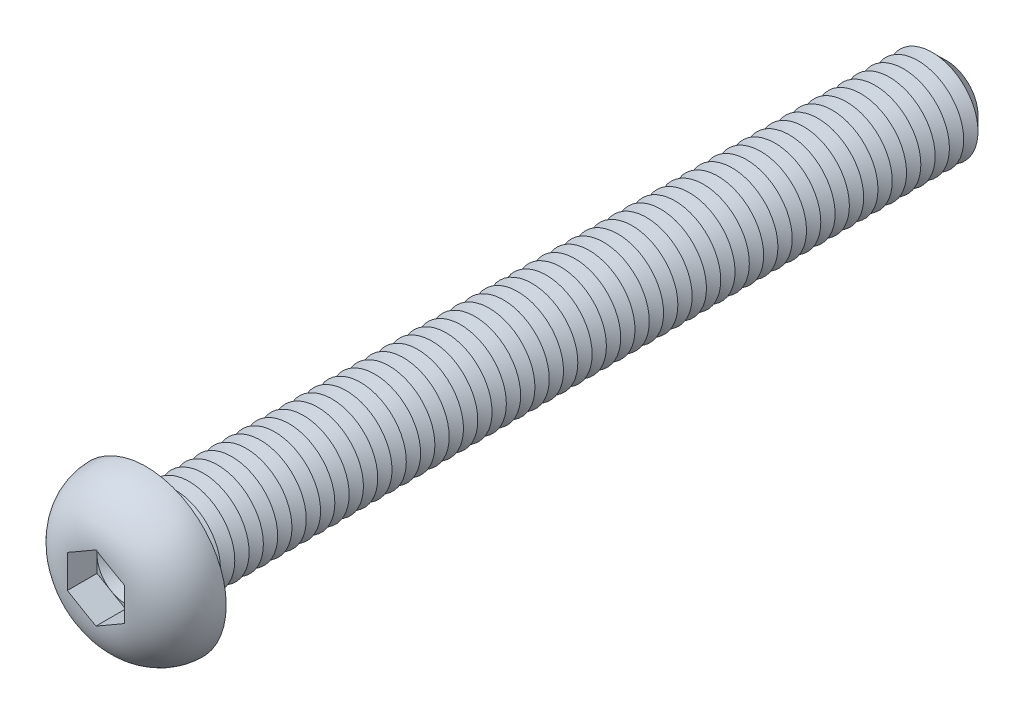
from build123d import *

# Parameters (mm, degrees)
CUT_EXTRUDE1_DEPTH  = 2.6
SKETCH4_R           = 4
BOSS_EXTRUDE1_DEPTH = 70
CHAMFER1_SIZE       = 1.25
LPATTERN1_COUNT     = 54
LPATTERN1_PITCH     = 1.25
FILLET2_R           = 0.5


with BuildPart() as part:
    # Sketch2 → Revolve1 (revolve)
    with BuildSketch(Plane(origin=(0, 0, 0), x_dir=(0, 0, -1), z_dir=(1, 0, 0)), mode=Mode.PRIVATE) as revolve1_sk:
        with BuildLine():
            Line((0, 0), (-4.4, 0))
            Line((-4.4, 0), (-4.4, 2.501111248))
            ThreePointArc((-4.4, 2.501111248), (-3.117141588, 5.647537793), (0, 7))
            Line((0, 7), (0, 0))
        make_face()
    revolve(revolve1_sk.sketch.rotate(Axis((0, 0, 47.934239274), (0, 0, -1)), 90), axis=Axis((0, 0, 47.934239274), (0, 0, -1)))

    # Sketch3 → Cut-Extrude1 (cut)
    with BuildSketch(Plane.XY.offset(4.4)):
        Polygon((0, 2.886751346), (-2.5, 1.443375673), (-2.5, -1.443375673), (0, -2.886751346), (2.5, -1.443375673), (2.5, 1.443375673), align=None)
    extrude(amount=-CUT_EXTRUDE1_DEPTH, mode=Mode.SUBTRACT)

    # Sketch4 → Boss-Extrude1 (add)
    with BuildSketch(Plane(origin=(0, 0, 0), x_dir=(-1, 0, 0), z_dir=(0, 0, -1))):
        with Locations(Location((0, 0, 0), (0, 0, 180))):
            Circle(SKETCH4_R)
    extrude(amount=BOSS_EXTRUDE1_DEPTH)

    # Chamfer1
    chamfer1_edges = [part.edges().sort_by_distance(p)[0] for p in [
        (-4, 0, -70),
    ]]
    chamfer(chamfer1_edges, length=CHAMFER1_SIZE)

    # Sketch5 → Cut-Revolve1 (revolve, cut)
    with BuildSketch(Plane(origin=(0, 0, 0), x_dir=(0, 0, -1), z_dir=(1, 0, 0)), mode=Mode.PRIVATE) as cut_revolve1_sk:
        Polygon((1.25, 4), (2.5, 4), (1.875, 2.917468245), align=None)
    cut_revolve1 = revolve(cut_revolve1_sk.sketch.rotate(Axis((0, 0, 47.934239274), (0, 0, -1)), 90), axis=Axis((0, 0, 47.934239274), (0, 0, -1)), mode=Mode.SUBTRACT)

    # LPattern1: Cut-Revolve1 ×54
    with Locations(*[(0, 0, -i * LPATTERN1_PITCH) for i in range(1, LPATTERN1_COUNT)]):
        add(cut_revolve1, mode=Mode.SUBTRACT)

    # Fillet2
    fillet2_edges = [part.edges().sort_by_distance(p)[0] for p in [
        (-4, 0, 0),
    ]]
    fillet(fillet2_edges, radius=FILLET2_R)

    # Cut-Extrude2 cone 1 section (on through the dimple's axis) → Cut-Extrude2 (revolve, cut)
    with BuildSketch(Plane(origin=(0, 0, 1.8), x_dir=(0, -1, 0), z_dir=(1, 0, 0))):
        Polygon((0, 0), (2.5, 0), (0, 1.443375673), align=None)
    revolve(axis=Axis((0, 0, 1.8), (0, 0, -1)), mode=Mode.SUBTRACT)


solid = part.part
